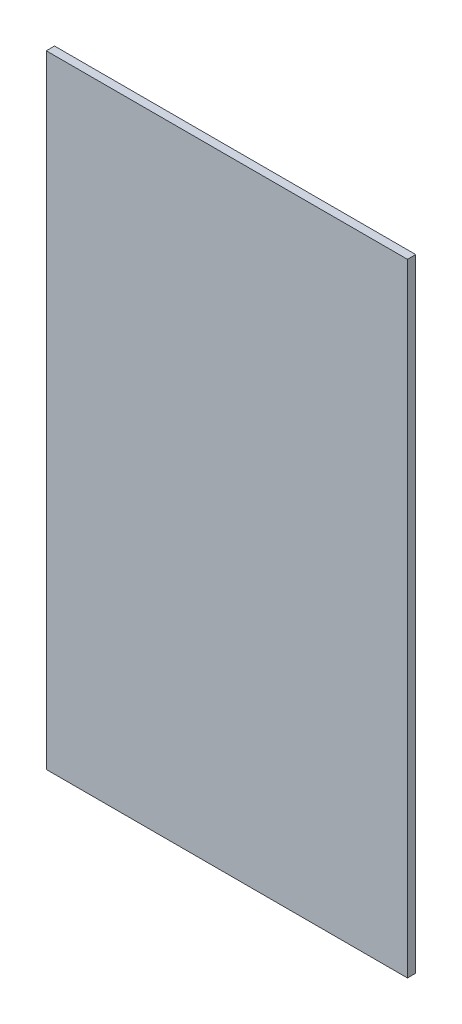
ISO-10303-21;
HEADER;
FILE_DESCRIPTION(('STEP AP214'),'2;1');
FILE_NAME('part.step','',(''),(''),'','','');
FILE_SCHEMA(('AUTOMOTIVE_DESIGN { 1 0 10303 214 1 1 1 1 }'));
ENDSEC;
DATA;
#1=APPLICATION_CONTEXT('core data for automotive mechanical design processes');
#2=APPLICATION_PROTOCOL_DEFINITION('international standard','automotive_design',2000,#1);
#3=PRODUCT_CONTEXT('',#1,'mechanical');
#4=PRODUCT('Part','Part','',(#3));
#5=PRODUCT_RELATED_PRODUCT_CATEGORY('part','',(#4));
#6=PRODUCT_DEFINITION_FORMATION('','',#4);
#7=PRODUCT_DEFINITION_CONTEXT('part definition',#1,'design');
#8=PRODUCT_DEFINITION('design','',#6,#7);
#9=PRODUCT_DEFINITION_SHAPE('','',#8);
#10=(LENGTH_UNIT() NAMED_UNIT(*) SI_UNIT(.MILLI.,.METRE.));
#11=(NAMED_UNIT(*) PLANE_ANGLE_UNIT() SI_UNIT($,.RADIAN.));
#12=(NAMED_UNIT(*) SI_UNIT($,.STERADIAN.) SOLID_ANGLE_UNIT());
#13=UNCERTAINTY_MEASURE_WITH_UNIT(LENGTH_MEASURE(1.E-05),#10,'distance_accuracy_value','');
#14=(GEOMETRIC_REPRESENTATION_CONTEXT(3) GLOBAL_UNCERTAINTY_ASSIGNED_CONTEXT((#13)) GLOBAL_UNIT_ASSIGNED_CONTEXT((#10,
#11,#12)) REPRESENTATION_CONTEXT('',''));
#15=CARTESIAN_POINT('',(0.,0.,0.));
#16=DIRECTION('',(0.,0.,1.));
#17=DIRECTION('',(1.,0.,0.));
#18=AXIS2_PLACEMENT_3D('',#15,#16,#17);
#19=CARTESIAN_POINT('',(-381.,1183.8,15.875));
#20=DIRECTION('',(0.,1.,0.));
#21=DIRECTION('',(0.,0.,1.));
#22=AXIS2_PLACEMENT_3D('',#19,#20,#21);
#23=PLANE('',#22);
#24=DIRECTION('',(1.,0.,0.));
#25=VECTOR('',#24,1.);
#26=CARTESIAN_POINT('',(-381.,1183.8,0.));
#27=LINE('',#26,#25);
#28=CARTESIAN_POINT('',(-752.79999997,1183.8,0.));
#29=VERTEX_POINT('',#28);
#30=CARTESIAN_POINT('',(-60.,1183.8,0.));
#31=VERTEX_POINT('',#30);
#32=EDGE_CURVE('E96',#29,#31,#27,.T.);
#33=ORIENTED_EDGE('',*,*,#32,.F.);
#34=DIRECTION('',(0.,0.,-1.));
#35=VECTOR('',#34,1.);
#36=CARTESIAN_POINT('',(-752.79999997,1183.8,15.875));
#37=LINE('',#36,#35);
#38=CARTESIAN_POINT('',(-752.79999997,1183.8,15.875));
#39=VERTEX_POINT('',#38);
#40=EDGE_CURVE('E11',#39,#29,#37,.T.);
#41=ORIENTED_EDGE('',*,*,#40,.F.);
#42=DIRECTION('',(1.,0.,0.));
#43=VECTOR('',#42,1.);
#44=CARTESIAN_POINT('',(-381.,1183.8,15.875));
#45=LINE('',#44,#43);
#46=CARTESIAN_POINT('',(-60.,1183.8,15.875));
#47=VERTEX_POINT('',#46);
#48=EDGE_CURVE('E81',#39,#47,#45,.T.);
#49=ORIENTED_EDGE('',*,*,#48,.T.);
#50=DIRECTION('',(0.,0.,-1.));
#51=VECTOR('',#50,1.);
#52=CARTESIAN_POINT('',(-60.,1183.8,15.875));
#53=LINE('',#52,#51);
#54=EDGE_CURVE('E49',#47,#31,#53,.T.);
#55=ORIENTED_EDGE('',*,*,#54,.T.);
#56=EDGE_LOOP('',(#33,#41,#49,#55));
#57=FACE_BOUND('',#56,.T.);
#58=ADVANCED_FACE('F33',(#57),#23,.T.);
#59=CARTESIAN_POINT('',(-752.79999997,-514.835936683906,15.875));
#60=DIRECTION('',(1.,0.,0.));
#61=DIRECTION('',(0.,0.,-1.));
#62=AXIS2_PLACEMENT_3D('',#59,#60,#61);
#63=PLANE('',#62);
#64=DIRECTION('',(0.,-1.,0.));
#65=VECTOR('',#64,1.);
#66=CARTESIAN_POINT('',(-752.79999997,-514.835936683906,0.));
#67=LINE('',#66,#65);
#68=CARTESIAN_POINT('',(-752.79999997,-10.,0.));
#69=VERTEX_POINT('',#68);
#70=EDGE_CURVE('E87',#29,#69,#67,.T.);
#71=ORIENTED_EDGE('',*,*,#70,.T.);
#72=DIRECTION('',(0.,0.,-1.));
#73=VECTOR('',#72,1.);
#74=CARTESIAN_POINT('',(-752.79999997,-10.,15.875));
#75=LINE('',#74,#73);
#76=CARTESIAN_POINT('',(-752.79999997,-10.,15.875));
#77=VERTEX_POINT('',#76);
#78=EDGE_CURVE('E41',#77,#69,#75,.T.);
#79=ORIENTED_EDGE('',*,*,#78,.F.);
#80=DIRECTION('',(0.,-1.,0.));
#81=VECTOR('',#80,1.);
#82=CARTESIAN_POINT('',(-752.79999997,-514.835936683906,15.875));
#83=LINE('',#82,#81);
#84=EDGE_CURVE('E75',#39,#77,#83,.T.);
#85=ORIENTED_EDGE('',*,*,#84,.F.);
#86=ORIENTED_EDGE('',*,*,#40,.T.);
#87=EDGE_LOOP('',(#71,#79,#85,#86));
#88=FACE_BOUND('',#87,.T.);
#89=ADVANCED_FACE('F85',(#88),#63,.F.);
#90=CARTESIAN_POINT('',(-381.,-10.,15.875));
#91=DIRECTION('',(0.,-1.,0.));
#92=DIRECTION('',(0.,0.,-1.));
#93=AXIS2_PLACEMENT_3D('',#90,#91,#92);
#94=PLANE('',#93);
#95=DIRECTION('',(-1.,0.,0.));
#96=VECTOR('',#95,1.);
#97=CARTESIAN_POINT('',(-381.,-10.,0.));
#98=LINE('',#97,#96);
#99=CARTESIAN_POINT('',(-60.,-10.,0.));
#100=VERTEX_POINT('',#99);
#101=EDGE_CURVE('E99',#100,#69,#98,.T.);
#102=ORIENTED_EDGE('',*,*,#101,.F.);
#103=DIRECTION('',(0.,0.,-1.));
#104=VECTOR('',#103,1.);
#105=CARTESIAN_POINT('',(-60.,-10.,15.875));
#106=LINE('',#105,#104);
#107=CARTESIAN_POINT('',(-60.,-10.,15.875));
#108=VERTEX_POINT('',#107);
#109=EDGE_CURVE('E62',#108,#100,#106,.T.);
#110=ORIENTED_EDGE('',*,*,#109,.F.);
#111=DIRECTION('',(-1.,0.,0.));
#112=VECTOR('',#111,1.);
#113=CARTESIAN_POINT('',(-381.,-10.,15.875));
#114=LINE('',#113,#112);
#115=EDGE_CURVE('E80',#108,#77,#114,.T.);
#116=ORIENTED_EDGE('',*,*,#115,.T.);
#117=ORIENTED_EDGE('',*,*,#78,.T.);
#118=EDGE_LOOP('',(#102,#110,#116,#117));
#119=FACE_BOUND('',#118,.T.);
#120=ADVANCED_FACE('F90',(#119),#94,.T.);
#121=CARTESIAN_POINT('',(-60.,-514.835936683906,15.875));
#122=DIRECTION('',(1.,0.,0.));
#123=DIRECTION('',(0.,0.,-1.));
#124=AXIS2_PLACEMENT_3D('',#121,#122,#123);
#125=PLANE('',#124);
#126=DIRECTION('',(0.,-1.,0.));
#127=VECTOR('',#126,1.);
#128=CARTESIAN_POINT('',(-60.,-514.835936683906,0.));
#129=LINE('',#128,#127);
#130=EDGE_CURVE('E101',#31,#100,#129,.T.);
#131=ORIENTED_EDGE('',*,*,#130,.F.);
#132=ORIENTED_EDGE('',*,*,#54,.F.);
#133=DIRECTION('',(0.,-1.,0.));
#134=VECTOR('',#133,1.);
#135=CARTESIAN_POINT('',(-60.,-514.835936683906,15.875));
#136=LINE('',#135,#134);
#137=EDGE_CURVE('E91',#47,#108,#136,.T.);
#138=ORIENTED_EDGE('',*,*,#137,.T.);
#139=ORIENTED_EDGE('',*,*,#109,.T.);
#140=EDGE_LOOP('',(#131,#132,#138,#139));
#141=FACE_BOUND('',#140,.T.);
#142=ADVANCED_FACE('F106',(#141),#125,.T.);
#143=CARTESIAN_POINT('',(-381.,-514.835936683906,15.875));
#144=DIRECTION('',(0.,0.,1.));
#145=DIRECTION('',(1.,0.,0.));
#146=AXIS2_PLACEMENT_3D('',#143,#144,#145);
#147=PLANE('',#146);
#148=ORIENTED_EDGE('',*,*,#48,.F.);
#149=ORIENTED_EDGE('',*,*,#84,.T.);
#150=ORIENTED_EDGE('',*,*,#115,.F.);
#151=ORIENTED_EDGE('',*,*,#137,.F.);
#152=EDGE_LOOP('',(#148,#149,#150,#151));
#153=FACE_BOUND('',#152,.T.);
#154=ADVANCED_FACE('F77',(#153),#147,.T.);
#155=CARTESIAN_POINT('',(-381.,-514.835936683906,0.));
#156=DIRECTION('',(0.,0.,1.));
#157=DIRECTION('',(1.,0.,0.));
#158=AXIS2_PLACEMENT_3D('',#155,#156,#157);
#159=PLANE('',#158);
#160=ORIENTED_EDGE('',*,*,#32,.T.);
#161=ORIENTED_EDGE('',*,*,#130,.T.);
#162=ORIENTED_EDGE('',*,*,#101,.T.);
#163=ORIENTED_EDGE('',*,*,#70,.F.);
#164=EDGE_LOOP('',(#160,#161,#162,#163));
#165=FACE_BOUND('',#164,.T.);
#166=ADVANCED_FACE('F113',(#165),#159,.F.);
#167=CLOSED_SHELL('',(#58,#89,#120,#142,#154,#166));
#168=MANIFOLD_SOLID_BREP('B2',#167);
#169=ADVANCED_BREP_SHAPE_REPRESENTATION('',(#18,#168),#14);
#170=SHAPE_DEFINITION_REPRESENTATION(#9,#169);
ENDSEC;
END-ISO-10303-21;
